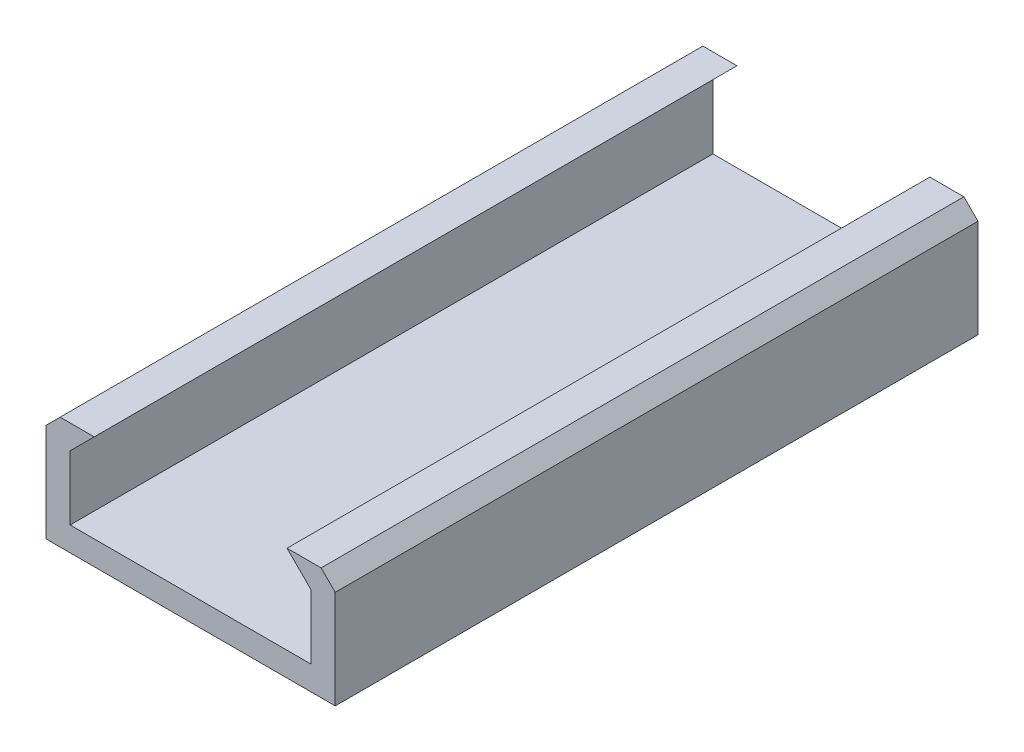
ISO-10303-21;
HEADER;
FILE_DESCRIPTION(('STEP AP214'),'2;1');
FILE_NAME('part.step','',(''),(''),'','','');
FILE_SCHEMA(('AUTOMOTIVE_DESIGN { 1 0 10303 214 1 1 1 1 }'));
ENDSEC;
DATA;
#1=APPLICATION_CONTEXT('core data for automotive mechanical design processes');
#2=APPLICATION_PROTOCOL_DEFINITION('international standard','automotive_design',2000,#1);
#3=PRODUCT_CONTEXT('',#1,'mechanical');
#4=PRODUCT('Part','Part','',(#3));
#5=PRODUCT_RELATED_PRODUCT_CATEGORY('part','',(#4));
#6=PRODUCT_DEFINITION_FORMATION('','',#4);
#7=PRODUCT_DEFINITION_CONTEXT('part definition',#1,'design');
#8=PRODUCT_DEFINITION('design','',#6,#7);
#9=PRODUCT_DEFINITION_SHAPE('','',#8);
#10=(LENGTH_UNIT() NAMED_UNIT(*) SI_UNIT(.MILLI.,.METRE.));
#11=(NAMED_UNIT(*) PLANE_ANGLE_UNIT() SI_UNIT($,.RADIAN.));
#12=(NAMED_UNIT(*) SI_UNIT($,.STERADIAN.) SOLID_ANGLE_UNIT());
#13=UNCERTAINTY_MEASURE_WITH_UNIT(LENGTH_MEASURE(1.E-05),#10,'distance_accuracy_value','');
#14=(GEOMETRIC_REPRESENTATION_CONTEXT(3) GLOBAL_UNCERTAINTY_ASSIGNED_CONTEXT((#13)) GLOBAL_UNIT_ASSIGNED_CONTEXT((#10,
#11,#12)) REPRESENTATION_CONTEXT('',''));
#15=CARTESIAN_POINT('',(0.,0.,0.));
#16=DIRECTION('',(0.,0.,1.));
#17=DIRECTION('',(1.,0.,0.));
#18=AXIS2_PLACEMENT_3D('',#15,#16,#17);
#19=CARTESIAN_POINT('',(-47.625,0.,-254.));
#20=DIRECTION('',(1.,0.,0.));
#21=DIRECTION('',(0.,0.,-1.));
#22=AXIS2_PLACEMENT_3D('',#19,#20,#21);
#23=PLANE('',#22);
#24=DIRECTION('',(0.,1.,0.));
#25=VECTOR('',#24,1.);
#26=CARTESIAN_POINT('',(-47.625,0.,0.));
#27=LINE('',#26,#25);
#28=CARTESIAN_POINT('',(-47.625,0.,0.));
#29=VERTEX_POINT('',#28);
#30=CARTESIAN_POINT('',(-47.625,25.4,0.));
#31=VERTEX_POINT('',#30);
#32=EDGE_CURVE('E153',#29,#31,#27,.T.);
#33=ORIENTED_EDGE('',*,*,#32,.F.);
#34=DIRECTION('',(0.,0.,1.));
#35=VECTOR('',#34,1.);
#36=CARTESIAN_POINT('',(-47.625,0.,-254.));
#37=LINE('',#36,#35);
#38=CARTESIAN_POINT('',(-47.625,0.,-254.));
#39=VERTEX_POINT('',#38);
#40=EDGE_CURVE('E11',#39,#29,#37,.T.);
#41=ORIENTED_EDGE('',*,*,#40,.F.);
#42=DIRECTION('',(0.,1.,0.));
#43=VECTOR('',#42,1.);
#44=CARTESIAN_POINT('',(-47.625,0.,-254.));
#45=LINE('',#44,#43);
#46=CARTESIAN_POINT('',(-47.625,25.4,-254.));
#47=VERTEX_POINT('',#46);
#48=EDGE_CURVE('E185',#39,#47,#45,.T.);
#49=ORIENTED_EDGE('',*,*,#48,.T.);
#50=DIRECTION('',(0.,0.,1.));
#51=VECTOR('',#50,1.);
#52=CARTESIAN_POINT('',(-47.625,25.4,-254.));
#53=LINE('',#52,#51);
#54=EDGE_CURVE('E35',#47,#31,#53,.T.);
#55=ORIENTED_EDGE('',*,*,#54,.T.);
#56=EDGE_LOOP('',(#33,#41,#49,#55));
#57=FACE_BOUND('',#56,.T.);
#58=ADVANCED_FACE('F32',(#57),#23,.T.);
#59=CARTESIAN_POINT('',(-47.625,0.,-254.));
#60=DIRECTION('',(0.,1.,0.));
#61=DIRECTION('',(0.,0.,1.));
#62=AXIS2_PLACEMENT_3D('',#59,#60,#61);
#63=PLANE('',#62);
#64=DIRECTION('',(-1.,0.,0.));
#65=VECTOR('',#64,1.);
#66=CARTESIAN_POINT('',(-47.625,0.,0.));
#67=LINE('',#66,#65);
#68=CARTESIAN_POINT('',(47.625,0.,0.));
#69=VERTEX_POINT('',#68);
#70=EDGE_CURVE('E183',#69,#29,#67,.T.);
#71=ORIENTED_EDGE('',*,*,#70,.F.);
#72=DIRECTION('',(0.,0.,1.));
#73=VECTOR('',#72,1.);
#74=CARTESIAN_POINT('',(47.625,0.,-254.));
#75=LINE('',#74,#73);
#76=CARTESIAN_POINT('',(47.625,0.,-254.));
#77=VERTEX_POINT('',#76);
#78=EDGE_CURVE('E41',#77,#69,#75,.T.);
#79=ORIENTED_EDGE('',*,*,#78,.F.);
#80=DIRECTION('',(-1.,0.,0.));
#81=VECTOR('',#80,1.);
#82=CARTESIAN_POINT('',(-47.625,0.,-254.));
#83=LINE('',#82,#81);
#84=EDGE_CURVE('E143',#77,#39,#83,.T.);
#85=ORIENTED_EDGE('',*,*,#84,.T.);
#86=ORIENTED_EDGE('',*,*,#40,.T.);
#87=EDGE_LOOP('',(#71,#79,#85,#86));
#88=FACE_BOUND('',#87,.T.);
#89=ADVANCED_FACE('F205',(#88),#63,.T.);
#90=CARTESIAN_POINT('',(47.625,0.,-254.));
#91=DIRECTION('',(-1.,0.,0.));
#92=DIRECTION('',(0.,0.,1.));
#93=AXIS2_PLACEMENT_3D('',#90,#91,#92);
#94=PLANE('',#93);
#95=DIRECTION('',(0.,-1.,0.));
#96=VECTOR('',#95,1.);
#97=CARTESIAN_POINT('',(47.625,0.,0.));
#98=LINE('',#97,#96);
#99=CARTESIAN_POINT('',(47.625,25.4,0.));
#100=VERTEX_POINT('',#99);
#101=EDGE_CURVE('E130',#100,#69,#98,.T.);
#102=ORIENTED_EDGE('',*,*,#101,.F.);
#103=DIRECTION('',(0.,0.,1.));
#104=VECTOR('',#103,1.);
#105=CARTESIAN_POINT('',(47.625,25.4,-254.));
#106=LINE('',#105,#104);
#107=CARTESIAN_POINT('',(47.625,25.4,-254.));
#108=VERTEX_POINT('',#107);
#109=EDGE_CURVE('E125',#108,#100,#106,.T.);
#110=ORIENTED_EDGE('',*,*,#109,.F.);
#111=DIRECTION('',(0.,-1.,0.));
#112=VECTOR('',#111,1.);
#113=CARTESIAN_POINT('',(47.625,0.,-254.));
#114=LINE('',#113,#112);
#115=EDGE_CURVE('E128',#108,#77,#114,.T.);
#116=ORIENTED_EDGE('',*,*,#115,.T.);
#117=ORIENTED_EDGE('',*,*,#78,.T.);
#118=EDGE_LOOP('',(#102,#110,#116,#117));
#119=FACE_BOUND('',#118,.T.);
#120=ADVANCED_FACE('F127',(#119),#94,.T.);
#121=CARTESIAN_POINT('',(38.1,34.925,-254.));
#122=DIRECTION('',(-0.707106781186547,-0.707106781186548,0.));
#123=DIRECTION('',(0.707106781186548,-0.707106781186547,0.));
#124=AXIS2_PLACEMENT_3D('',#121,#122,#123);
#125=PLANE('',#124);
#126=DIRECTION('',(0.707106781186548,-0.707106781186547,0.));
#127=VECTOR('',#126,1.);
#128=CARTESIAN_POINT('',(38.1,34.925,0.));
#129=LINE('',#128,#127);
#130=CARTESIAN_POINT('',(38.1,34.925,0.));
#131=VERTEX_POINT('',#130);
#132=EDGE_CURVE('E180',#131,#100,#129,.T.);
#133=ORIENTED_EDGE('',*,*,#132,.F.);
#134=DIRECTION('',(0.,0.,1.));
#135=VECTOR('',#134,1.);
#136=CARTESIAN_POINT('',(38.1,34.925,-254.));
#137=LINE('',#136,#135);
#138=CARTESIAN_POINT('',(38.1,34.925,-254.));
#139=VERTEX_POINT('',#138);
#140=EDGE_CURVE('E135',#139,#131,#137,.T.);
#141=ORIENTED_EDGE('',*,*,#140,.F.);
#142=DIRECTION('',(0.707106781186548,-0.707106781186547,0.));
#143=VECTOR('',#142,1.);
#144=CARTESIAN_POINT('',(38.1,34.925,-254.));
#145=LINE('',#144,#143);
#146=EDGE_CURVE('E141',#139,#108,#145,.T.);
#147=ORIENTED_EDGE('',*,*,#146,.T.);
#148=ORIENTED_EDGE('',*,*,#109,.T.);
#149=EDGE_LOOP('',(#133,#141,#147,#148));
#150=FACE_BOUND('',#149,.T.);
#151=ADVANCED_FACE('F145',(#150),#125,.T.);
#152=CARTESIAN_POINT('',(38.1,34.925,-254.));
#153=DIRECTION('',(0.,1.,0.));
#154=DIRECTION('',(-1.,0.,0.));
#155=AXIS2_PLACEMENT_3D('',#152,#153,#154);
#156=PLANE('',#155);
#157=DIRECTION('',(-1.,0.,0.));
#158=VECTOR('',#157,1.);
#159=CARTESIAN_POINT('',(38.1,34.925,0.));
#160=LINE('',#159,#158);
#161=CARTESIAN_POINT('',(51.5703841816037,34.925,0.));
#162=VERTEX_POINT('',#161);
#163=EDGE_CURVE('E177',#162,#131,#160,.T.);
#164=ORIENTED_EDGE('',*,*,#163,.F.);
#165=DIRECTION('',(0.,0.,1.));
#166=VECTOR('',#165,1.);
#167=CARTESIAN_POINT('',(51.5703841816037,34.925,-254.));
#168=LINE('',#167,#166);
#169=CARTESIAN_POINT('',(51.5703841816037,34.925,-254.));
#170=VERTEX_POINT('',#169);
#171=EDGE_CURVE('E189',#170,#162,#168,.T.);
#172=ORIENTED_EDGE('',*,*,#171,.F.);
#173=DIRECTION('',(-1.,0.,0.));
#174=VECTOR('',#173,1.);
#175=CARTESIAN_POINT('',(38.1,34.925,-254.));
#176=LINE('',#175,#174);
#177=EDGE_CURVE('E146',#170,#139,#176,.T.);
#178=ORIENTED_EDGE('',*,*,#177,.T.);
#179=ORIENTED_EDGE('',*,*,#140,.T.);
#180=EDGE_LOOP('',(#164,#172,#178,#179));
#181=FACE_BOUND('',#180,.T.);
#182=ADVANCED_FACE('F218',(#181),#156,.T.);
#183=CARTESIAN_POINT('',(51.5703841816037,34.925,-254.));
#184=DIRECTION('',(0.707106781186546,0.707106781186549,0.));
#185=DIRECTION('',(-0.707106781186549,0.707106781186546,0.));
#186=AXIS2_PLACEMENT_3D('',#183,#184,#185);
#187=PLANE('',#186);
#188=DIRECTION('',(-0.707106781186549,0.707106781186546,0.));
#189=VECTOR('',#188,1.);
#190=CARTESIAN_POINT('',(51.5703841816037,34.925,0.));
#191=LINE('',#190,#189);
#192=CARTESIAN_POINT('',(57.15,29.3453841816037,0.));
#193=VERTEX_POINT('',#192);
#194=EDGE_CURVE('E174',#193,#162,#191,.T.);
#195=ORIENTED_EDGE('',*,*,#194,.F.);
#196=DIRECTION('',(0.,0.,1.));
#197=VECTOR('',#196,1.);
#198=CARTESIAN_POINT('',(57.15,29.3453841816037,-254.));
#199=LINE('',#198,#197);
#200=CARTESIAN_POINT('',(57.15,29.3453841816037,-254.));
#201=VERTEX_POINT('',#200);
#202=EDGE_CURVE('E191',#201,#193,#199,.T.);
#203=ORIENTED_EDGE('',*,*,#202,.F.);
#204=DIRECTION('',(-0.707106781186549,0.707106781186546,0.));
#205=VECTOR('',#204,1.);
#206=CARTESIAN_POINT('',(51.5703841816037,34.925,-254.));
#207=LINE('',#206,#205);
#208=EDGE_CURVE('E148',#201,#170,#207,.T.);
#209=ORIENTED_EDGE('',*,*,#208,.T.);
#210=ORIENTED_EDGE('',*,*,#171,.T.);
#211=EDGE_LOOP('',(#195,#203,#209,#210));
#212=FACE_BOUND('',#211,.T.);
#213=ADVANCED_FACE('F221',(#212),#187,.T.);
#214=CARTESIAN_POINT('',(57.15,-9.525,-254.));
#215=DIRECTION('',(1.,0.,0.));
#216=DIRECTION('',(0.,0.,-1.));
#217=AXIS2_PLACEMENT_3D('',#214,#215,#216);
#218=PLANE('',#217);
#219=DIRECTION('',(0.,1.,0.));
#220=VECTOR('',#219,1.);
#221=CARTESIAN_POINT('',(57.15,-9.525,0.));
#222=LINE('',#221,#220);
#223=CARTESIAN_POINT('',(57.15,-9.525,0.));
#224=VERTEX_POINT('',#223);
#225=EDGE_CURVE('E171',#224,#193,#222,.T.);
#226=ORIENTED_EDGE('',*,*,#225,.F.);
#227=DIRECTION('',(0.,0.,1.));
#228=VECTOR('',#227,1.);
#229=CARTESIAN_POINT('',(57.15,-9.525,-254.));
#230=LINE('',#229,#228);
#231=CARTESIAN_POINT('',(57.15,-9.525,-254.));
#232=VERTEX_POINT('',#231);
#233=EDGE_CURVE('E193',#232,#224,#230,.T.);
#234=ORIENTED_EDGE('',*,*,#233,.F.);
#235=DIRECTION('',(0.,1.,0.));
#236=VECTOR('',#235,1.);
#237=CARTESIAN_POINT('',(57.15,-9.525,-254.));
#238=LINE('',#237,#236);
#239=EDGE_CURVE('E347',#232,#201,#238,.T.);
#240=ORIENTED_EDGE('',*,*,#239,.T.);
#241=ORIENTED_EDGE('',*,*,#202,.T.);
#242=EDGE_LOOP('',(#226,#234,#240,#241));
#243=FACE_BOUND('',#242,.T.);
#244=ADVANCED_FACE('F225',(#243),#218,.T.);
#245=CARTESIAN_POINT('',(-57.15,-9.525,-254.));
#246=DIRECTION('',(0.,-1.,0.));
#247=DIRECTION('',(0.,0.,-1.));
#248=AXIS2_PLACEMENT_3D('',#245,#246,#247);
#249=PLANE('',#248);
#250=DIRECTION('',(1.,0.,0.));
#251=VECTOR('',#250,1.);
#252=CARTESIAN_POINT('',(-57.15,-9.525,0.));
#253=LINE('',#252,#251);
#254=CARTESIAN_POINT('',(-57.15,-9.525,0.));
#255=VERTEX_POINT('',#254);
#256=EDGE_CURVE('E168',#255,#224,#253,.T.);
#257=ORIENTED_EDGE('',*,*,#256,.F.);
#258=DIRECTION('',(0.,0.,1.));
#259=VECTOR('',#258,1.);
#260=CARTESIAN_POINT('',(-57.15,-9.525,-254.));
#261=LINE('',#260,#259);
#262=CARTESIAN_POINT('',(-57.15,-9.525,-254.));
#263=VERTEX_POINT('',#262);
#264=EDGE_CURVE('E195',#263,#255,#261,.T.);
#265=ORIENTED_EDGE('',*,*,#264,.F.);
#266=DIRECTION('',(1.,0.,0.));
#267=VECTOR('',#266,1.);
#268=CARTESIAN_POINT('',(-57.15,-9.525,-254.));
#269=LINE('',#268,#267);
#270=EDGE_CURVE('E351',#263,#232,#269,.T.);
#271=ORIENTED_EDGE('',*,*,#270,.T.);
#272=ORIENTED_EDGE('',*,*,#233,.T.);
#273=EDGE_LOOP('',(#257,#265,#271,#272));
#274=FACE_BOUND('',#273,.T.);
#275=ADVANCED_FACE('F229',(#274),#249,.T.);
#276=CARTESIAN_POINT('',(-57.15,-9.525,-254.));
#277=DIRECTION('',(-1.,0.,0.));
#278=DIRECTION('',(0.,0.,1.));
#279=AXIS2_PLACEMENT_3D('',#276,#277,#278);
#280=PLANE('',#279);
#281=DIRECTION('',(0.,-1.,0.));
#282=VECTOR('',#281,1.);
#283=CARTESIAN_POINT('',(-57.15,-9.525,0.));
#284=LINE('',#283,#282);
#285=CARTESIAN_POINT('',(-57.15,29.3453841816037,0.));
#286=VERTEX_POINT('',#285);
#287=EDGE_CURVE('E165',#286,#255,#284,.T.);
#288=ORIENTED_EDGE('',*,*,#287,.F.);
#289=DIRECTION('',(0.,0.,1.));
#290=VECTOR('',#289,1.);
#291=CARTESIAN_POINT('',(-57.15,29.3453841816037,-254.));
#292=LINE('',#291,#290);
#293=CARTESIAN_POINT('',(-57.15,29.3453841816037,-254.));
#294=VERTEX_POINT('',#293);
#295=EDGE_CURVE('E197',#294,#286,#292,.T.);
#296=ORIENTED_EDGE('',*,*,#295,.F.);
#297=DIRECTION('',(0.,-1.,0.));
#298=VECTOR('',#297,1.);
#299=CARTESIAN_POINT('',(-57.15,-9.525,-254.));
#300=LINE('',#299,#298);
#301=EDGE_CURVE('E340',#294,#263,#300,.T.);
#302=ORIENTED_EDGE('',*,*,#301,.T.);
#303=ORIENTED_EDGE('',*,*,#264,.T.);
#304=EDGE_LOOP('',(#288,#296,#302,#303));
#305=FACE_BOUND('',#304,.T.);
#306=ADVANCED_FACE('F233',(#305),#280,.T.);
#307=CARTESIAN_POINT('',(-57.15,29.3453841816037,-254.));
#308=DIRECTION('',(-0.707106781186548,0.707106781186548,0.));
#309=DIRECTION('',(-0.707106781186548,-0.707106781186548,0.));
#310=AXIS2_PLACEMENT_3D('',#307,#308,#309);
#311=PLANE('',#310);
#312=DIRECTION('',(-0.707106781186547,-0.707106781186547,0.));
#313=VECTOR('',#312,1.);
#314=CARTESIAN_POINT('',(-57.15,29.3453841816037,0.));
#315=LINE('',#314,#313);
#316=CARTESIAN_POINT('',(-51.5703841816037,34.925,0.));
#317=VERTEX_POINT('',#316);
#318=EDGE_CURVE('E162',#317,#286,#315,.T.);
#319=ORIENTED_EDGE('',*,*,#318,.F.);
#320=DIRECTION('',(0.,0.,1.));
#321=VECTOR('',#320,1.);
#322=CARTESIAN_POINT('',(-51.5703841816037,34.925,-254.));
#323=LINE('',#322,#321);
#324=CARTESIAN_POINT('',(-51.5703841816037,34.925,-254.));
#325=VERTEX_POINT('',#324);
#326=EDGE_CURVE('E199',#325,#317,#323,.T.);
#327=ORIENTED_EDGE('',*,*,#326,.F.);
#328=DIRECTION('',(-0.707106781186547,-0.707106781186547,0.));
#329=VECTOR('',#328,1.);
#330=CARTESIAN_POINT('',(-57.15,29.3453841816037,-254.));
#331=LINE('',#330,#329);
#332=EDGE_CURVE('E336',#325,#294,#331,.T.);
#333=ORIENTED_EDGE('',*,*,#332,.T.);
#334=ORIENTED_EDGE('',*,*,#295,.T.);
#335=EDGE_LOOP('',(#319,#327,#333,#334));
#336=FACE_BOUND('',#335,.T.);
#337=ADVANCED_FACE('F237',(#336),#311,.T.);
#338=CARTESIAN_POINT('',(-51.5703841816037,34.925,-254.));
#339=DIRECTION('',(0.,1.,0.));
#340=DIRECTION('',(-1.,0.,0.));
#341=AXIS2_PLACEMENT_3D('',#338,#339,#340);
#342=PLANE('',#341);
#343=DIRECTION('',(-1.,0.,0.));
#344=VECTOR('',#343,1.);
#345=CARTESIAN_POINT('',(-51.5703841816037,34.925,0.));
#346=LINE('',#345,#344);
#347=CARTESIAN_POINT('',(-38.1,34.925,0.));
#348=VERTEX_POINT('',#347);
#349=EDGE_CURVE('E159',#348,#317,#346,.T.);
#350=ORIENTED_EDGE('',*,*,#349,.F.);
#351=DIRECTION('',(0.,0.,1.));
#352=VECTOR('',#351,1.);
#353=CARTESIAN_POINT('',(-38.1,34.925,-254.));
#354=LINE('',#353,#352);
#355=CARTESIAN_POINT('',(-38.1,34.925,-254.));
#356=VERTEX_POINT('',#355);
#357=EDGE_CURVE('E200',#356,#348,#354,.T.);
#358=ORIENTED_EDGE('',*,*,#357,.F.);
#359=DIRECTION('',(-1.,0.,0.));
#360=VECTOR('',#359,1.);
#361=CARTESIAN_POINT('',(-51.5703841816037,34.925,-254.));
#362=LINE('',#361,#360);
#363=EDGE_CURVE('E357',#356,#325,#362,.T.);
#364=ORIENTED_EDGE('',*,*,#363,.T.);
#365=ORIENTED_EDGE('',*,*,#326,.T.);
#366=EDGE_LOOP('',(#350,#358,#364,#365));
#367=FACE_BOUND('',#366,.T.);
#368=ADVANCED_FACE('F241',(#367),#342,.T.);
#369=CARTESIAN_POINT('',(-47.625,25.4,-254.));
#370=DIRECTION('',(0.707106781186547,-0.707106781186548,0.));
#371=DIRECTION('',(0.707106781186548,0.707106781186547,0.));
#372=AXIS2_PLACEMENT_3D('',#369,#370,#371);
#373=PLANE('',#372);
#374=DIRECTION('',(0.707106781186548,0.707106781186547,0.));
#375=VECTOR('',#374,1.);
#376=CARTESIAN_POINT('',(-47.625,25.4,0.));
#377=LINE('',#376,#375);
#378=EDGE_CURVE('E156',#31,#348,#377,.T.);
#379=ORIENTED_EDGE('',*,*,#378,.F.);
#380=ORIENTED_EDGE('',*,*,#54,.F.);
#381=DIRECTION('',(0.707106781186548,0.707106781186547,0.));
#382=VECTOR('',#381,1.);
#383=CARTESIAN_POINT('',(-47.625,25.4,-254.));
#384=LINE('',#383,#382);
#385=EDGE_CURVE('E359',#47,#356,#384,.T.);
#386=ORIENTED_EDGE('',*,*,#385,.T.);
#387=ORIENTED_EDGE('',*,*,#357,.T.);
#388=EDGE_LOOP('',(#379,#380,#386,#387));
#389=FACE_BOUND('',#388,.T.);
#390=ADVANCED_FACE('F202',(#389),#373,.T.);
#391=CARTESIAN_POINT('',(-47.625,-9.525,-254.));
#392=DIRECTION('',(0.,0.,-1.));
#393=DIRECTION('',(-1.,0.,0.));
#394=AXIS2_PLACEMENT_3D('',#391,#392,#393);
#395=PLANE('',#394);
#396=ORIENTED_EDGE('',*,*,#48,.F.);
#397=ORIENTED_EDGE('',*,*,#84,.F.);
#398=ORIENTED_EDGE('',*,*,#115,.F.);
#399=ORIENTED_EDGE('',*,*,#146,.F.);
#400=ORIENTED_EDGE('',*,*,#177,.F.);
#401=ORIENTED_EDGE('',*,*,#208,.F.);
#402=ORIENTED_EDGE('',*,*,#239,.F.);
#403=ORIENTED_EDGE('',*,*,#270,.F.);
#404=ORIENTED_EDGE('',*,*,#301,.F.);
#405=ORIENTED_EDGE('',*,*,#332,.F.);
#406=ORIENTED_EDGE('',*,*,#363,.F.);
#407=ORIENTED_EDGE('',*,*,#385,.F.);
#408=EDGE_LOOP('',(#396,#397,#398,#399,#400,#401,#402,#403,#404,#405,#406,#407));
#409=FACE_BOUND('',#408,.T.);
#410=ADVANCED_FACE('F139',(#409),#395,.T.);
#411=CARTESIAN_POINT('',(-47.625,-9.525,0.));
#412=DIRECTION('',(0.,0.,-1.));
#413=DIRECTION('',(-1.,0.,0.));
#414=AXIS2_PLACEMENT_3D('',#411,#412,#413);
#415=PLANE('',#414);
#416=ORIENTED_EDGE('',*,*,#32,.T.);
#417=ORIENTED_EDGE('',*,*,#378,.T.);
#418=ORIENTED_EDGE('',*,*,#349,.T.);
#419=ORIENTED_EDGE('',*,*,#318,.T.);
#420=ORIENTED_EDGE('',*,*,#287,.T.);
#421=ORIENTED_EDGE('',*,*,#256,.T.);
#422=ORIENTED_EDGE('',*,*,#225,.T.);
#423=ORIENTED_EDGE('',*,*,#194,.T.);
#424=ORIENTED_EDGE('',*,*,#163,.T.);
#425=ORIENTED_EDGE('',*,*,#132,.T.);
#426=ORIENTED_EDGE('',*,*,#101,.T.);
#427=ORIENTED_EDGE('',*,*,#70,.T.);
#428=EDGE_LOOP('',(#416,#417,#418,#419,#420,#421,#422,#423,#424,#425,#426,#427));
#429=FACE_BOUND('',#428,.T.);
#430=ADVANCED_FACE('F204',(#429),#415,.F.);
#431=CLOSED_SHELL('',(#58,#89,#120,#151,#182,#213,#244,#275,#306,#337,#368,#390,#410,#430));
#432=MANIFOLD_SOLID_BREP('B2',#431);
#433=ADVANCED_BREP_SHAPE_REPRESENTATION('',(#18,#432),#14);
#434=SHAPE_DEFINITION_REPRESENTATION(#9,#433);
ENDSEC;
END-ISO-10303-21;
